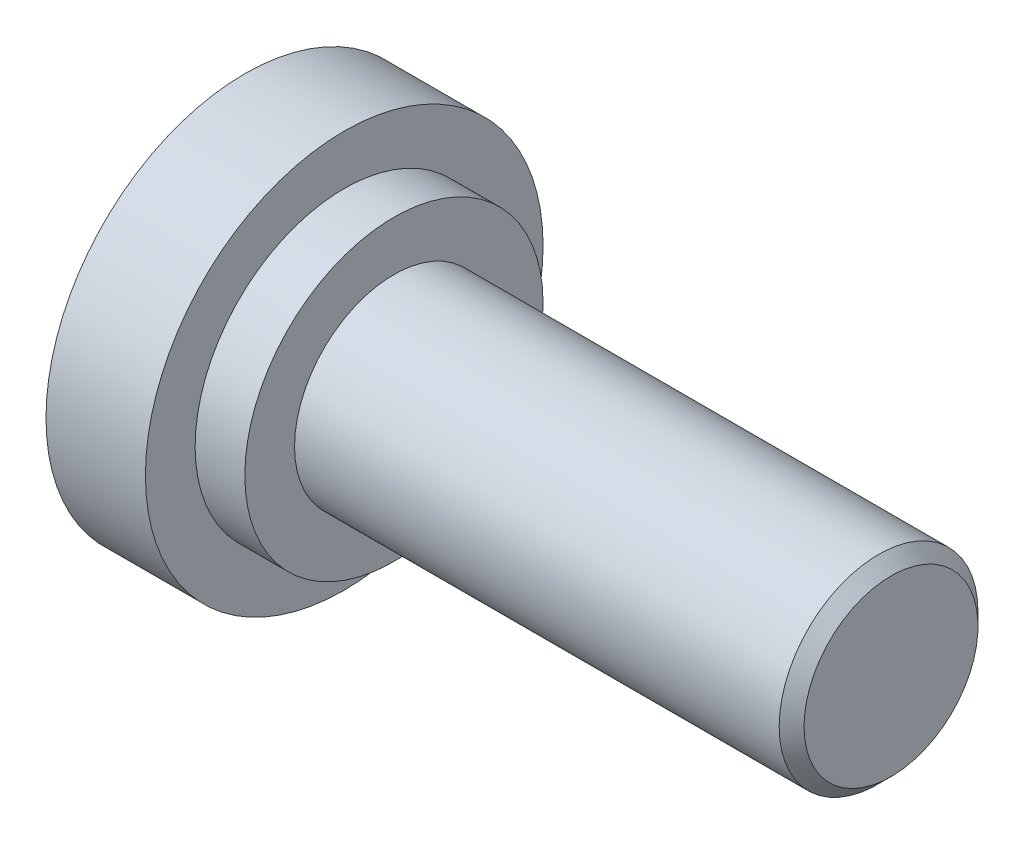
from build123d import *

# Parameters (mm, degrees)
CHANFREIN1_SIZE = 0.5


with BuildPart() as part:
    # Esquisse1 → Base-R_volution (revolve)
    with BuildSketch(Plane.XY, mode=Mode.PRIVATE) as base_r_volution_sk:
        Polygon((0, 0), (0, 8), (4, 8), (4, 6), (6, 6), (6, 4), (26, 4), (26, 0), align=None)
    revolve(base_r_volution_sk.sketch.rotate(Axis((-4.18019429, 0, 0), (1, 0, 0)), 90), axis=Axis((-4.18019429, 0, 0), (1, 0, 0)))

    # Chanfrein1
    chanfrein1_edges = [part.edges().sort_by_distance(p)[0] for p in [
        (26, 0, -4),
    ]]
    chamfer(chanfrein1_edges, length=CHANFREIN1_SIZE)


solid = part.part
